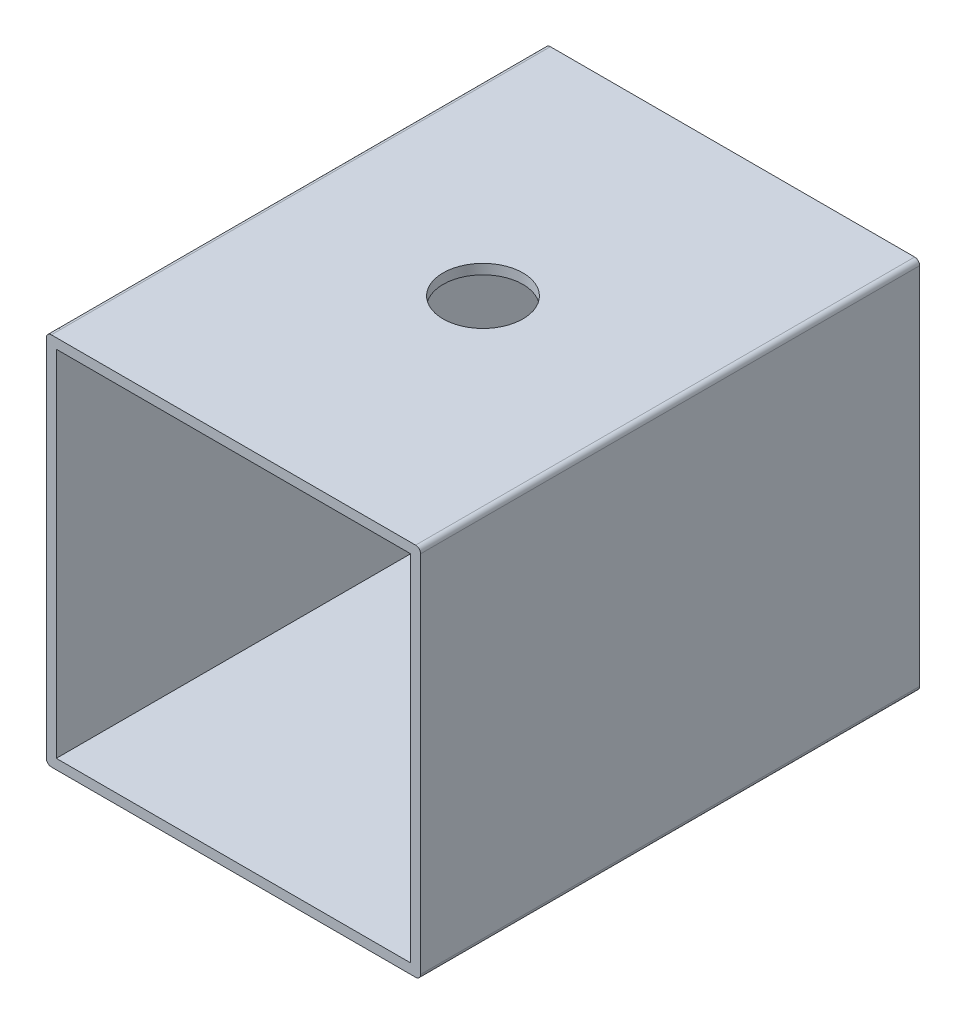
ISO-10303-21;
HEADER;
FILE_DESCRIPTION(('STEP AP214'),'2;1');
FILE_NAME('part.step','',(''),(''),'','','');
FILE_SCHEMA(('AUTOMOTIVE_DESIGN { 1 0 10303 214 1 1 1 1 }'));
ENDSEC;
DATA;
#1=APPLICATION_CONTEXT('core data for automotive mechanical design processes');
#2=APPLICATION_PROTOCOL_DEFINITION('international standard','automotive_design',2000,#1);
#3=PRODUCT_CONTEXT('',#1,'mechanical');
#4=PRODUCT('Part','Part','',(#3));
#5=PRODUCT_RELATED_PRODUCT_CATEGORY('part','',(#4));
#6=PRODUCT_DEFINITION_FORMATION('','',#4);
#7=PRODUCT_DEFINITION_CONTEXT('part definition',#1,'design');
#8=PRODUCT_DEFINITION('design','',#6,#7);
#9=PRODUCT_DEFINITION_SHAPE('','',#8);
#10=(LENGTH_UNIT() NAMED_UNIT(*) SI_UNIT(.MILLI.,.METRE.));
#11=(NAMED_UNIT(*) PLANE_ANGLE_UNIT() SI_UNIT($,.RADIAN.));
#12=(NAMED_UNIT(*) SI_UNIT($,.STERADIAN.) SOLID_ANGLE_UNIT());
#13=UNCERTAINTY_MEASURE_WITH_UNIT(LENGTH_MEASURE(1.E-05),#10,'distance_accuracy_value','');
#14=(GEOMETRIC_REPRESENTATION_CONTEXT(3) GLOBAL_UNCERTAINTY_ASSIGNED_CONTEXT((#13)) GLOBAL_UNIT_ASSIGNED_CONTEXT((#10,
#11,#12)) REPRESENTATION_CONTEXT('',''));
#15=CARTESIAN_POINT('',(0.,0.,0.));
#16=DIRECTION('',(0.,0.,1.));
#17=DIRECTION('',(1.,0.,0.));
#18=AXIS2_PLACEMENT_3D('',#15,#16,#17);
#19=CARTESIAN_POINT('',(2.,2.,200.));
#20=DIRECTION('',(0.,0.,-1.));
#21=DIRECTION('',(-1.,0.,0.));
#22=AXIS2_PLACEMENT_3D('',#19,#20,#21);
#23=PLANE('',#22);
#24=CARTESIAN_POINT('',(2.,2.,200.));
#25=DIRECTION('',(0.,0.,1.));
#26=DIRECTION('',(-1.,0.,0.));
#27=AXIS2_PLACEMENT_3D('',#24,#25,#26);
#28=CIRCLE('',#27,2.);
#29=CARTESIAN_POINT('',(0.,2.00000000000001,200.));
#30=VERTEX_POINT('',#29);
#31=CARTESIAN_POINT('',(2.00000000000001,0.,200.));
#32=VERTEX_POINT('',#31);
#33=EDGE_CURVE('E160',#30,#32,#28,.T.);
#34=ORIENTED_EDGE('',*,*,#33,.T.);
#35=DIRECTION('',(1.,0.,0.));
#36=VECTOR('',#35,1.);
#37=CARTESIAN_POINT('',(2.00000000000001,0.,200.));
#38=LINE('',#37,#36);
#39=CARTESIAN_POINT('',(148.,0.,200.));
#40=VERTEX_POINT('',#39);
#41=EDGE_CURVE('E163',#32,#40,#38,.T.);
#42=ORIENTED_EDGE('',*,*,#41,.T.);
#43=CARTESIAN_POINT('',(148.,2.,200.));
#44=DIRECTION('',(0.,0.,1.));
#45=DIRECTION('',(1.,0.,0.));
#46=AXIS2_PLACEMENT_3D('',#43,#44,#45);
#47=CIRCLE('',#46,2.);
#48=CARTESIAN_POINT('',(150.,2.00000000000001,200.));
#49=VERTEX_POINT('',#48);
#50=EDGE_CURVE('E166',#40,#49,#47,.T.);
#51=ORIENTED_EDGE('',*,*,#50,.T.);
#52=DIRECTION('',(0.,1.,0.));
#53=VECTOR('',#52,1.);
#54=CARTESIAN_POINT('',(150.,2.00000000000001,200.));
#55=LINE('',#54,#53);
#56=CARTESIAN_POINT('',(150.,148.,200.));
#57=VERTEX_POINT('',#56);
#58=EDGE_CURVE('E168',#49,#57,#55,.T.);
#59=ORIENTED_EDGE('',*,*,#58,.T.);
#60=CARTESIAN_POINT('',(148.,148.,200.));
#61=DIRECTION('',(0.,0.,1.));
#62=DIRECTION('',(-1.,0.,0.));
#63=AXIS2_PLACEMENT_3D('',#60,#61,#62);
#64=CIRCLE('',#63,2.);
#65=CARTESIAN_POINT('',(148.,150.,200.));
#66=VERTEX_POINT('',#65);
#67=EDGE_CURVE('E170',#57,#66,#64,.T.);
#68=ORIENTED_EDGE('',*,*,#67,.T.);
#69=DIRECTION('',(-1.,0.,0.));
#70=VECTOR('',#69,1.);
#71=CARTESIAN_POINT('',(2.,150.,200.));
#72=LINE('',#71,#70);
#73=CARTESIAN_POINT('',(2.,150.,200.));
#74=VERTEX_POINT('',#73);
#75=EDGE_CURVE('E172',#66,#74,#72,.T.);
#76=ORIENTED_EDGE('',*,*,#75,.T.);
#77=CARTESIAN_POINT('',(2.,148.,200.));
#78=DIRECTION('',(0.,0.,1.));
#79=DIRECTION('',(-1.,0.,0.));
#80=AXIS2_PLACEMENT_3D('',#77,#78,#79);
#81=CIRCLE('',#80,2.);
#82=CARTESIAN_POINT('',(0.,148.,200.));
#83=VERTEX_POINT('',#82);
#84=EDGE_CURVE('E174',#74,#83,#81,.T.);
#85=ORIENTED_EDGE('',*,*,#84,.T.);
#86=DIRECTION('',(0.,-1.,0.));
#87=VECTOR('',#86,1.);
#88=CARTESIAN_POINT('',(0.,2.00000000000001,200.));
#89=LINE('',#88,#87);
#90=EDGE_CURVE('E176',#83,#30,#89,.T.);
#91=ORIENTED_EDGE('',*,*,#90,.T.);
#92=EDGE_LOOP('',(#34,#42,#51,#59,#68,#76,#85,#91));
#93=FACE_BOUND('',#92,.T.);
#94=DIRECTION('',(1.,0.,0.));
#95=VECTOR('',#94,1.);
#96=CARTESIAN_POINT('',(4.,4.,200.));
#97=LINE('',#96,#95);
#98=CARTESIAN_POINT('',(4.,4.,200.));
#99=VERTEX_POINT('',#98);
#100=CARTESIAN_POINT('',(146.,4.,200.));
#101=VERTEX_POINT('',#100);
#102=EDGE_CURVE('E123',#99,#101,#97,.T.);
#103=ORIENTED_EDGE('',*,*,#102,.F.);
#104=DIRECTION('',(0.,-1.,0.));
#105=VECTOR('',#104,1.);
#106=CARTESIAN_POINT('',(4.,4.,200.));
#107=LINE('',#106,#105);
#108=CARTESIAN_POINT('',(4.,146.,200.));
#109=VERTEX_POINT('',#108);
#110=EDGE_CURVE('E145',#109,#99,#107,.T.);
#111=ORIENTED_EDGE('',*,*,#110,.F.);
#112=DIRECTION('',(-1.,0.,0.));
#113=VECTOR('',#112,1.);
#114=CARTESIAN_POINT('',(4.,146.,200.));
#115=LINE('',#114,#113);
#116=CARTESIAN_POINT('',(146.,146.,200.));
#117=VERTEX_POINT('',#116);
#118=EDGE_CURVE('E143',#117,#109,#115,.T.);
#119=ORIENTED_EDGE('',*,*,#118,.F.);
#120=DIRECTION('',(0.,1.,0.));
#121=VECTOR('',#120,1.);
#122=CARTESIAN_POINT('',(146.,4.,200.));
#123=LINE('',#122,#121);
#124=EDGE_CURVE('E131',#101,#117,#123,.T.);
#125=ORIENTED_EDGE('',*,*,#124,.F.);
#126=EDGE_LOOP('',(#103,#111,#119,#125));
#127=FACE_BOUND('',#126,.T.);
#128=ADVANCED_FACE('F33',(#93,#127),#23,.F.);
#129=CARTESIAN_POINT('',(2.,2.,0.));
#130=DIRECTION('',(0.,0.,-1.));
#131=DIRECTION('',(-1.,0.,0.));
#132=AXIS2_PLACEMENT_3D('',#129,#130,#131);
#133=PLANE('',#132);
#134=CARTESIAN_POINT('',(2.,2.,0.));
#135=DIRECTION('',(0.,0.,1.));
#136=DIRECTION('',(-1.,0.,0.));
#137=AXIS2_PLACEMENT_3D('',#134,#135,#136);
#138=CIRCLE('',#137,2.);
#139=CARTESIAN_POINT('',(0.,2.00000000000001,0.));
#140=VERTEX_POINT('',#139);
#141=CARTESIAN_POINT('',(2.00000000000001,0.,0.));
#142=VERTEX_POINT('',#141);
#143=EDGE_CURVE('E139',#140,#142,#138,.T.);
#144=ORIENTED_EDGE('',*,*,#143,.F.);
#145=DIRECTION('',(0.,-1.,0.));
#146=VECTOR('',#145,1.);
#147=CARTESIAN_POINT('',(0.,2.00000000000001,0.));
#148=LINE('',#147,#146);
#149=CARTESIAN_POINT('',(0.,148.,0.));
#150=VERTEX_POINT('',#149);
#151=EDGE_CURVE('E164',#150,#140,#148,.T.);
#152=ORIENTED_EDGE('',*,*,#151,.F.);
#153=CARTESIAN_POINT('',(2.,148.,0.));
#154=DIRECTION('',(0.,0.,1.));
#155=DIRECTION('',(-1.,0.,0.));
#156=AXIS2_PLACEMENT_3D('',#153,#154,#155);
#157=CIRCLE('',#156,2.);
#158=CARTESIAN_POINT('',(2.,150.,0.));
#159=VERTEX_POINT('',#158);
#160=EDGE_CURVE('E191',#159,#150,#157,.T.);
#161=ORIENTED_EDGE('',*,*,#160,.F.);
#162=DIRECTION('',(-1.,0.,0.));
#163=VECTOR('',#162,1.);
#164=CARTESIAN_POINT('',(2.,150.,0.));
#165=LINE('',#164,#163);
#166=CARTESIAN_POINT('',(148.,150.,0.));
#167=VERTEX_POINT('',#166);
#168=EDGE_CURVE('E189',#167,#159,#165,.T.);
#169=ORIENTED_EDGE('',*,*,#168,.F.);
#170=CARTESIAN_POINT('',(148.,148.,0.));
#171=DIRECTION('',(0.,0.,1.));
#172=DIRECTION('',(-1.,0.,0.));
#173=AXIS2_PLACEMENT_3D('',#170,#171,#172);
#174=CIRCLE('',#173,2.);
#175=CARTESIAN_POINT('',(150.,148.,0.));
#176=VERTEX_POINT('',#175);
#177=EDGE_CURVE('E187',#176,#167,#174,.T.);
#178=ORIENTED_EDGE('',*,*,#177,.F.);
#179=DIRECTION('',(0.,1.,0.));
#180=VECTOR('',#179,1.);
#181=CARTESIAN_POINT('',(150.,2.00000000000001,0.));
#182=LINE('',#181,#180);
#183=CARTESIAN_POINT('',(150.,2.00000000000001,0.));
#184=VERTEX_POINT('',#183);
#185=EDGE_CURVE('E185',#184,#176,#182,.T.);
#186=ORIENTED_EDGE('',*,*,#185,.F.);
#187=CARTESIAN_POINT('',(148.,2.,0.));
#188=DIRECTION('',(0.,0.,1.));
#189=DIRECTION('',(1.,0.,0.));
#190=AXIS2_PLACEMENT_3D('',#187,#188,#189);
#191=CIRCLE('',#190,2.);
#192=CARTESIAN_POINT('',(148.,0.,0.));
#193=VERTEX_POINT('',#192);
#194=EDGE_CURVE('E183',#193,#184,#191,.T.);
#195=ORIENTED_EDGE('',*,*,#194,.F.);
#196=DIRECTION('',(1.,0.,0.));
#197=VECTOR('',#196,1.);
#198=CARTESIAN_POINT('',(2.00000000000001,0.,0.));
#199=LINE('',#198,#197);
#200=EDGE_CURVE('E181',#142,#193,#199,.T.);
#201=ORIENTED_EDGE('',*,*,#200,.F.);
#202=EDGE_LOOP('',(#144,#152,#161,#169,#178,#186,#195,#201));
#203=FACE_BOUND('',#202,.T.);
#204=DIRECTION('',(0.,-1.,0.));
#205=VECTOR('',#204,1.);
#206=CARTESIAN_POINT('',(4.,4.,0.));
#207=LINE('',#206,#205);
#208=CARTESIAN_POINT('',(4.,146.,0.));
#209=VERTEX_POINT('',#208);
#210=CARTESIAN_POINT('',(4.,4.,0.));
#211=VERTEX_POINT('',#210);
#212=EDGE_CURVE('E132',#209,#211,#207,.T.);
#213=ORIENTED_EDGE('',*,*,#212,.T.);
#214=DIRECTION('',(1.,0.,0.));
#215=VECTOR('',#214,1.);
#216=CARTESIAN_POINT('',(4.,4.,0.));
#217=LINE('',#216,#215);
#218=CARTESIAN_POINT('',(146.,4.,0.));
#219=VERTEX_POINT('',#218);
#220=EDGE_CURVE('E57',#211,#219,#217,.T.);
#221=ORIENTED_EDGE('',*,*,#220,.T.);
#222=DIRECTION('',(0.,1.,0.));
#223=VECTOR('',#222,1.);
#224=CARTESIAN_POINT('',(146.,4.,0.));
#225=LINE('',#224,#223);
#226=CARTESIAN_POINT('',(146.,146.,0.));
#227=VERTEX_POINT('',#226);
#228=EDGE_CURVE('E138',#219,#227,#225,.T.);
#229=ORIENTED_EDGE('',*,*,#228,.T.);
#230=DIRECTION('',(-1.,0.,0.));
#231=VECTOR('',#230,1.);
#232=CARTESIAN_POINT('',(4.,146.,0.));
#233=LINE('',#232,#231);
#234=EDGE_CURVE('E152',#227,#209,#233,.T.);
#235=ORIENTED_EDGE('',*,*,#234,.T.);
#236=EDGE_LOOP('',(#213,#221,#229,#235));
#237=FACE_BOUND('',#236,.T.);
#238=ADVANCED_FACE('F222',(#203,#237),#133,.T.);
#239=CARTESIAN_POINT('',(2.,2.,200.));
#240=DIRECTION('',(0.,0.,-1.));
#241=DIRECTION('',(-1.,0.,0.));
#242=AXIS2_PLACEMENT_3D('',#239,#240,#241);
#243=CYLINDRICAL_SURFACE('',#242,2.);
#244=ORIENTED_EDGE('',*,*,#143,.T.);
#245=DIRECTION('',(0.,0.,-1.));
#246=VECTOR('',#245,1.);
#247=CARTESIAN_POINT('',(2.00000000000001,0.,200.));
#248=LINE('',#247,#246);
#249=EDGE_CURVE('E11',#32,#142,#248,.T.);
#250=ORIENTED_EDGE('',*,*,#249,.F.);
#251=ORIENTED_EDGE('',*,*,#33,.F.);
#252=DIRECTION('',(0.,0.,-1.));
#253=VECTOR('',#252,1.);
#254=CARTESIAN_POINT('',(0.,2.00000000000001,200.));
#255=LINE('',#254,#253);
#256=EDGE_CURVE('E178',#30,#140,#255,.T.);
#257=ORIENTED_EDGE('',*,*,#256,.T.);
#258=EDGE_LOOP('',(#244,#250,#251,#257));
#259=FACE_BOUND('',#258,.T.);
#260=ADVANCED_FACE('F35',(#259),#243,.T.);
#261=CARTESIAN_POINT('',(2.00000000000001,0.,200.));
#262=DIRECTION('',(0.,1.,0.));
#263=DIRECTION('',(0.,0.,1.));
#264=AXIS2_PLACEMENT_3D('',#261,#262,#263);
#265=PLANE('',#264);
#266=ORIENTED_EDGE('',*,*,#200,.T.);
#267=DIRECTION('',(0.,0.,-1.));
#268=VECTOR('',#267,1.);
#269=CARTESIAN_POINT('',(148.,0.,200.));
#270=LINE('',#269,#268);
#271=EDGE_CURVE('E42',#40,#193,#270,.T.);
#272=ORIENTED_EDGE('',*,*,#271,.F.);
#273=ORIENTED_EDGE('',*,*,#41,.F.);
#274=ORIENTED_EDGE('',*,*,#249,.T.);
#275=EDGE_LOOP('',(#266,#272,#273,#274));
#276=FACE_BOUND('',#275,.T.);
#277=ADVANCED_FACE('F239',(#276),#265,.F.);
#278=CARTESIAN_POINT('',(148.,2.,200.));
#279=DIRECTION('',(0.,0.,-1.));
#280=DIRECTION('',(-1.,0.,0.));
#281=AXIS2_PLACEMENT_3D('',#278,#279,#280);
#282=CYLINDRICAL_SURFACE('',#281,2.);
#283=ORIENTED_EDGE('',*,*,#194,.T.);
#284=DIRECTION('',(0.,0.,-1.));
#285=VECTOR('',#284,1.);
#286=CARTESIAN_POINT('',(150.,2.00000000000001,200.));
#287=LINE('',#286,#285);
#288=EDGE_CURVE('E208',#49,#184,#287,.T.);
#289=ORIENTED_EDGE('',*,*,#288,.F.);
#290=ORIENTED_EDGE('',*,*,#50,.F.);
#291=ORIENTED_EDGE('',*,*,#271,.T.);
#292=EDGE_LOOP('',(#283,#289,#290,#291));
#293=FACE_BOUND('',#292,.T.);
#294=ADVANCED_FACE('F216',(#293),#282,.T.);
#295=CARTESIAN_POINT('',(150.,2.00000000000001,200.));
#296=DIRECTION('',(-1.,0.,0.));
#297=DIRECTION('',(0.,0.,1.));
#298=AXIS2_PLACEMENT_3D('',#295,#296,#297);
#299=PLANE('',#298);
#300=ORIENTED_EDGE('',*,*,#185,.T.);
#301=DIRECTION('',(0.,0.,-1.));
#302=VECTOR('',#301,1.);
#303=CARTESIAN_POINT('',(150.,148.,200.));
#304=LINE('',#303,#302);
#305=EDGE_CURVE('E205',#57,#176,#304,.T.);
#306=ORIENTED_EDGE('',*,*,#305,.F.);
#307=ORIENTED_EDGE('',*,*,#58,.F.);
#308=ORIENTED_EDGE('',*,*,#288,.T.);
#309=EDGE_LOOP('',(#300,#306,#307,#308));
#310=FACE_BOUND('',#309,.T.);
#311=ADVANCED_FACE('F228',(#310),#299,.F.);
#312=CARTESIAN_POINT('',(148.,148.,200.));
#313=DIRECTION('',(0.,0.,-1.));
#314=DIRECTION('',(-1.,0.,0.));
#315=AXIS2_PLACEMENT_3D('',#312,#313,#314);
#316=CYLINDRICAL_SURFACE('',#315,2.);
#317=ORIENTED_EDGE('',*,*,#177,.T.);
#318=DIRECTION('',(0.,0.,-1.));
#319=VECTOR('',#318,1.);
#320=CARTESIAN_POINT('',(148.,150.,200.));
#321=LINE('',#320,#319);
#322=EDGE_CURVE('E202',#66,#167,#321,.T.);
#323=ORIENTED_EDGE('',*,*,#322,.F.);
#324=ORIENTED_EDGE('',*,*,#67,.F.);
#325=ORIENTED_EDGE('',*,*,#305,.T.);
#326=EDGE_LOOP('',(#317,#323,#324,#325));
#327=FACE_BOUND('',#326,.T.);
#328=ADVANCED_FACE('F232',(#327),#316,.T.);
#329=CARTESIAN_POINT('',(2.,150.,200.));
#330=DIRECTION('',(0.,-1.,0.));
#331=DIRECTION('',(1.,0.,0.));
#332=AXIS2_PLACEMENT_3D('',#329,#330,#331);
#333=PLANE('',#332);
#334=CARTESIAN_POINT('',(75.,150.,100.));
#335=DIRECTION('',(0.,1.,0.));
#336=DIRECTION('',(-1.,0.,0.));
#337=AXIS2_PLACEMENT_3D('',#334,#335,#336);
#338=CIRCLE('',#337,16.);
#339=CARTESIAN_POINT('',(59.,150.,100.));
#340=VERTEX_POINT('',#339);
#341=EDGE_CURVE('E300',#340,#340,#338,.T.);
#342=ORIENTED_EDGE('',*,*,#341,.F.);
#343=EDGE_LOOP('',(#342));
#344=FACE_BOUND('',#343,.T.);
#345=ORIENTED_EDGE('',*,*,#168,.T.);
#346=DIRECTION('',(0.,0.,-1.));
#347=VECTOR('',#346,1.);
#348=CARTESIAN_POINT('',(2.,150.,200.));
#349=LINE('',#348,#347);
#350=EDGE_CURVE('E199',#74,#159,#349,.T.);
#351=ORIENTED_EDGE('',*,*,#350,.F.);
#352=ORIENTED_EDGE('',*,*,#75,.F.);
#353=ORIENTED_EDGE('',*,*,#322,.T.);
#354=EDGE_LOOP('',(#345,#351,#352,#353));
#355=FACE_BOUND('',#354,.T.);
#356=ADVANCED_FACE('F252',(#344,#355),#333,.F.);
#357=CARTESIAN_POINT('',(2.,148.,200.));
#358=DIRECTION('',(0.,0.,-1.));
#359=DIRECTION('',(-1.,0.,0.));
#360=AXIS2_PLACEMENT_3D('',#357,#358,#359);
#361=CYLINDRICAL_SURFACE('',#360,2.);
#362=ORIENTED_EDGE('',*,*,#160,.T.);
#363=DIRECTION('',(0.,0.,-1.));
#364=VECTOR('',#363,1.);
#365=CARTESIAN_POINT('',(0.,148.,200.));
#366=LINE('',#365,#364);
#367=EDGE_CURVE('E196',#83,#150,#366,.T.);
#368=ORIENTED_EDGE('',*,*,#367,.F.);
#369=ORIENTED_EDGE('',*,*,#84,.F.);
#370=ORIENTED_EDGE('',*,*,#350,.T.);
#371=EDGE_LOOP('',(#362,#368,#369,#370));
#372=FACE_BOUND('',#371,.T.);
#373=ADVANCED_FACE('F250',(#372),#361,.T.);
#374=CARTESIAN_POINT('',(0.,2.00000000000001,200.));
#375=DIRECTION('',(1.,0.,0.));
#376=DIRECTION('',(0.,0.,-1.));
#377=AXIS2_PLACEMENT_3D('',#374,#375,#376);
#378=PLANE('',#377);
#379=ORIENTED_EDGE('',*,*,#151,.T.);
#380=ORIENTED_EDGE('',*,*,#256,.F.);
#381=ORIENTED_EDGE('',*,*,#90,.F.);
#382=ORIENTED_EDGE('',*,*,#367,.T.);
#383=EDGE_LOOP('',(#379,#380,#381,#382));
#384=FACE_BOUND('',#383,.T.);
#385=ADVANCED_FACE('F245',(#384),#378,.F.);
#386=CARTESIAN_POINT('',(4.,4.,200.));
#387=DIRECTION('',(0.,1.,0.));
#388=DIRECTION('',(0.,0.,1.));
#389=AXIS2_PLACEMENT_3D('',#386,#387,#388);
#390=PLANE('',#389);
#391=ORIENTED_EDGE('',*,*,#220,.F.);
#392=DIRECTION('',(0.,0.,-1.));
#393=VECTOR('',#392,1.);
#394=CARTESIAN_POINT('',(4.,4.,200.));
#395=LINE('',#394,#393);
#396=EDGE_CURVE('E127',#99,#211,#395,.T.);
#397=ORIENTED_EDGE('',*,*,#396,.F.);
#398=ORIENTED_EDGE('',*,*,#102,.T.);
#399=DIRECTION('',(0.,0.,-1.));
#400=VECTOR('',#399,1.);
#401=CARTESIAN_POINT('',(146.,4.,200.));
#402=LINE('',#401,#400);
#403=EDGE_CURVE('E126',#101,#219,#402,.T.);
#404=ORIENTED_EDGE('',*,*,#403,.T.);
#405=EDGE_LOOP('',(#391,#397,#398,#404));
#406=FACE_BOUND('',#405,.T.);
#407=ADVANCED_FACE('F125',(#406),#390,.T.);
#408=CARTESIAN_POINT('',(146.,4.,200.));
#409=DIRECTION('',(-1.,0.,0.));
#410=DIRECTION('',(0.,0.,1.));
#411=AXIS2_PLACEMENT_3D('',#408,#409,#410);
#412=PLANE('',#411);
#413=ORIENTED_EDGE('',*,*,#228,.F.);
#414=ORIENTED_EDGE('',*,*,#403,.F.);
#415=ORIENTED_EDGE('',*,*,#124,.T.);
#416=DIRECTION('',(0.,0.,-1.));
#417=VECTOR('',#416,1.);
#418=CARTESIAN_POINT('',(146.,146.,200.));
#419=LINE('',#418,#417);
#420=EDGE_CURVE('E140',#117,#227,#419,.T.);
#421=ORIENTED_EDGE('',*,*,#420,.T.);
#422=EDGE_LOOP('',(#413,#414,#415,#421));
#423=FACE_BOUND('',#422,.T.);
#424=ADVANCED_FACE('F135',(#423),#412,.T.);
#425=CARTESIAN_POINT('',(4.,146.,200.));
#426=DIRECTION('',(0.,-1.,0.));
#427=DIRECTION('',(0.,0.,-1.));
#428=AXIS2_PLACEMENT_3D('',#425,#426,#427);
#429=PLANE('',#428);
#430=CARTESIAN_POINT('',(75.,146.,100.));
#431=DIRECTION('',(0.,-1.,0.));
#432=DIRECTION('',(0.,0.,-1.));
#433=AXIS2_PLACEMENT_3D('',#430,#431,#432);
#434=CIRCLE('',#433,16.);
#435=CARTESIAN_POINT('',(75.,146.,84.));
#436=VERTEX_POINT('',#435);
#437=EDGE_CURVE('E37',#436,#436,#434,.T.);
#438=ORIENTED_EDGE('',*,*,#437,.F.);
#439=EDGE_LOOP('',(#438));
#440=FACE_BOUND('',#439,.T.);
#441=ORIENTED_EDGE('',*,*,#234,.F.);
#442=ORIENTED_EDGE('',*,*,#420,.F.);
#443=ORIENTED_EDGE('',*,*,#118,.T.);
#444=DIRECTION('',(0.,0.,-1.));
#445=VECTOR('',#444,1.);
#446=CARTESIAN_POINT('',(4.,146.,200.));
#447=LINE('',#446,#445);
#448=EDGE_CURVE('E49',#109,#209,#447,.T.);
#449=ORIENTED_EDGE('',*,*,#448,.T.);
#450=EDGE_LOOP('',(#441,#442,#443,#449));
#451=FACE_BOUND('',#450,.T.);
#452=ADVANCED_FACE('F281',(#440,#451),#429,.T.);
#453=CARTESIAN_POINT('',(4.,4.,200.));
#454=DIRECTION('',(1.,0.,0.));
#455=DIRECTION('',(0.,0.,-1.));
#456=AXIS2_PLACEMENT_3D('',#453,#454,#455);
#457=PLANE('',#456);
#458=ORIENTED_EDGE('',*,*,#212,.F.);
#459=ORIENTED_EDGE('',*,*,#448,.F.);
#460=ORIENTED_EDGE('',*,*,#110,.T.);
#461=ORIENTED_EDGE('',*,*,#396,.T.);
#462=EDGE_LOOP('',(#458,#459,#460,#461));
#463=FACE_BOUND('',#462,.T.);
#464=ADVANCED_FACE('F285',(#463),#457,.T.);
#465=CARTESIAN_POINT('',(75.,140.,100.));
#466=DIRECTION('',(0.,1.,0.));
#467=DIRECTION('',(-1.,0.,0.));
#468=AXIS2_PLACEMENT_3D('',#465,#466,#467);
#469=CYLINDRICAL_SURFACE('',#468,16.);
#470=ORIENTED_EDGE('',*,*,#437,.T.);
#471=EDGE_LOOP('',(#470));
#472=FACE_BOUND('',#471,.T.);
#473=ORIENTED_EDGE('',*,*,#341,.T.);
#474=EDGE_LOOP('',(#473));
#475=FACE_BOUND('',#474,.T.);
#476=ADVANCED_FACE('F291',(#472,#475),#469,.F.);
#477=CLOSED_SHELL('',(#128,#238,#260,#277,#294,#311,#328,#356,#373,#385,#407,#424,#452,#464,#476));
#478=MANIFOLD_SOLID_BREP('B2',#477);
#479=ADVANCED_BREP_SHAPE_REPRESENTATION('',(#18,#478),#14);
#480=SHAPE_DEFINITION_REPRESENTATION(#9,#479);
ENDSEC;
END-ISO-10303-21;
